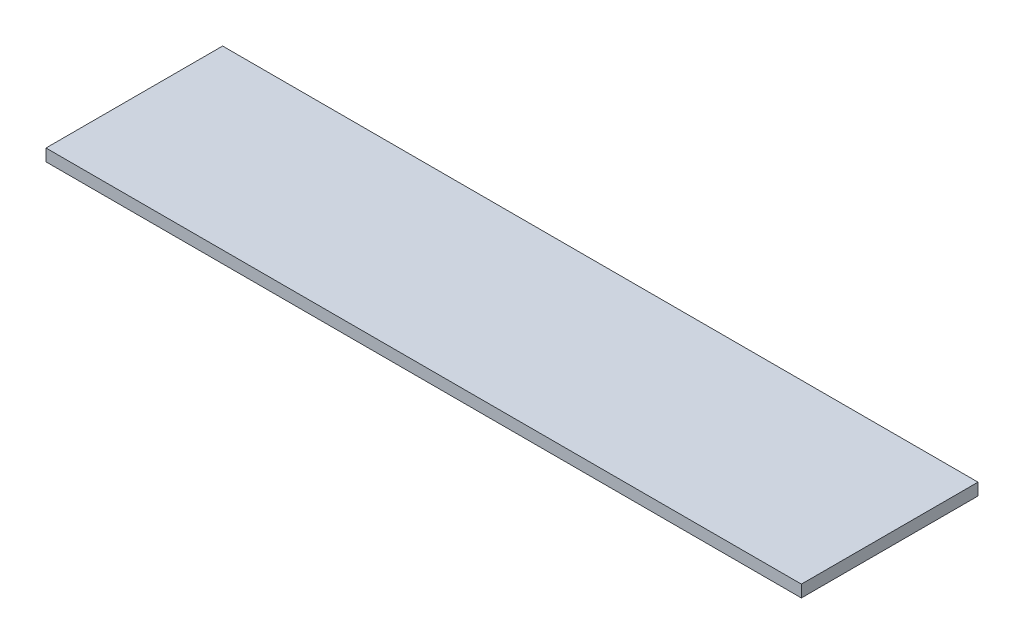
ISO-10303-21;
HEADER;
FILE_DESCRIPTION(('STEP AP214'),'2;1');
FILE_NAME('part.step','',(''),(''),'','','');
FILE_SCHEMA(('AUTOMOTIVE_DESIGN { 1 0 10303 214 1 1 1 1 }'));
ENDSEC;
DATA;
#1=APPLICATION_CONTEXT('core data for automotive mechanical design processes');
#2=APPLICATION_PROTOCOL_DEFINITION('international standard','automotive_design',2000,#1);
#3=PRODUCT_CONTEXT('',#1,'mechanical');
#4=PRODUCT('Part','Part','',(#3));
#5=PRODUCT_RELATED_PRODUCT_CATEGORY('part','',(#4));
#6=PRODUCT_DEFINITION_FORMATION('','',#4);
#7=PRODUCT_DEFINITION_CONTEXT('part definition',#1,'design');
#8=PRODUCT_DEFINITION('design','',#6,#7);
#9=PRODUCT_DEFINITION_SHAPE('','',#8);
#10=(LENGTH_UNIT() NAMED_UNIT(*) SI_UNIT(.MILLI.,.METRE.));
#11=(NAMED_UNIT(*) PLANE_ANGLE_UNIT() SI_UNIT($,.RADIAN.));
#12=(NAMED_UNIT(*) SI_UNIT($,.STERADIAN.) SOLID_ANGLE_UNIT());
#13=UNCERTAINTY_MEASURE_WITH_UNIT(LENGTH_MEASURE(1.E-05),#10,'distance_accuracy_value','');
#14=(GEOMETRIC_REPRESENTATION_CONTEXT(3) GLOBAL_UNCERTAINTY_ASSIGNED_CONTEXT((#13)) GLOBAL_UNIT_ASSIGNED_CONTEXT((#10,
#11,#12)) REPRESENTATION_CONTEXT('',''));
#15=CARTESIAN_POINT('',(0.,0.,0.));
#16=DIRECTION('',(0.,0.,1.));
#17=DIRECTION('',(1.,0.,0.));
#18=AXIS2_PLACEMENT_3D('',#15,#16,#17);
#19=CARTESIAN_POINT('',(598.782,19.05,140.));
#20=DIRECTION('',(-1.,0.,0.));
#21=DIRECTION('',(0.,0.,1.));
#22=AXIS2_PLACEMENT_3D('',#19,#20,#21);
#23=PLANE('',#22);
#24=DIRECTION('',(0.,0.,-1.));
#25=VECTOR('',#24,1.);
#26=CARTESIAN_POINT('',(598.782,0.,140.));
#27=LINE('',#26,#25);
#28=CARTESIAN_POINT('',(598.782,0.,140.));
#29=VERTEX_POINT('',#28);
#30=CARTESIAN_POINT('',(598.782,0.,-140.));
#31=VERTEX_POINT('',#30);
#32=EDGE_CURVE('E113',#29,#31,#27,.T.);
#33=ORIENTED_EDGE('',*,*,#32,.T.);
#34=DIRECTION('',(0.,-1.,0.));
#35=VECTOR('',#34,1.);
#36=CARTESIAN_POINT('',(598.782,19.05,-140.));
#37=LINE('',#36,#35);
#38=CARTESIAN_POINT('',(598.782,19.05,-140.));
#39=VERTEX_POINT('',#38);
#40=EDGE_CURVE('E11',#39,#31,#37,.T.);
#41=ORIENTED_EDGE('',*,*,#40,.F.);
#42=DIRECTION('',(0.,0.,-1.));
#43=VECTOR('',#42,1.);
#44=CARTESIAN_POINT('',(598.782,19.05,140.));
#45=LINE('',#44,#43);
#46=CARTESIAN_POINT('',(598.782,19.05,140.));
#47=VERTEX_POINT('',#46);
#48=EDGE_CURVE('E97',#47,#39,#45,.T.);
#49=ORIENTED_EDGE('',*,*,#48,.F.);
#50=DIRECTION('',(0.,-1.,0.));
#51=VECTOR('',#50,1.);
#52=CARTESIAN_POINT('',(598.782,19.05,140.));
#53=LINE('',#52,#51);
#54=EDGE_CURVE('E107',#47,#29,#53,.T.);
#55=ORIENTED_EDGE('',*,*,#54,.T.);
#56=EDGE_LOOP('',(#33,#41,#49,#55));
#57=FACE_BOUND('',#56,.T.);
#58=ADVANCED_FACE('F44',(#57),#23,.F.);
#59=CARTESIAN_POINT('',(598.782,19.05,-140.));
#60=DIRECTION('',(0.,0.,1.));
#61=DIRECTION('',(1.,0.,0.));
#62=AXIS2_PLACEMENT_3D('',#59,#60,#61);
#63=PLANE('',#62);
#64=DIRECTION('',(-1.,0.,0.));
#65=VECTOR('',#64,1.);
#66=CARTESIAN_POINT('',(598.782,0.,-140.));
#67=LINE('',#66,#65);
#68=CARTESIAN_POINT('',(-598.782,0.,-140.));
#69=VERTEX_POINT('',#68);
#70=EDGE_CURVE('E105',#31,#69,#67,.T.);
#71=ORIENTED_EDGE('',*,*,#70,.T.);
#72=DIRECTION('',(0.,-1.,0.));
#73=VECTOR('',#72,1.);
#74=CARTESIAN_POINT('',(-598.782,19.05,-140.));
#75=LINE('',#74,#73);
#76=CARTESIAN_POINT('',(-598.782,19.05,-140.));
#77=VERTEX_POINT('',#76);
#78=EDGE_CURVE('E53',#77,#69,#75,.T.);
#79=ORIENTED_EDGE('',*,*,#78,.F.);
#80=DIRECTION('',(-1.,0.,0.));
#81=VECTOR('',#80,1.);
#82=CARTESIAN_POINT('',(598.782,19.05,-140.));
#83=LINE('',#82,#81);
#84=EDGE_CURVE('E95',#39,#77,#83,.T.);
#85=ORIENTED_EDGE('',*,*,#84,.F.);
#86=ORIENTED_EDGE('',*,*,#40,.T.);
#87=EDGE_LOOP('',(#71,#79,#85,#86));
#88=FACE_BOUND('',#87,.T.);
#89=ADVANCED_FACE('F103',(#88),#63,.F.);
#90=CARTESIAN_POINT('',(-598.782,19.05,140.));
#91=DIRECTION('',(1.,0.,0.));
#92=DIRECTION('',(0.,0.,-1.));
#93=AXIS2_PLACEMENT_3D('',#90,#91,#92);
#94=PLANE('',#93);
#95=DIRECTION('',(0.,0.,1.));
#96=VECTOR('',#95,1.);
#97=CARTESIAN_POINT('',(-598.782,0.,140.));
#98=LINE('',#97,#96);
#99=CARTESIAN_POINT('',(-598.782,0.,140.));
#100=VERTEX_POINT('',#99);
#101=EDGE_CURVE('E79',#69,#100,#98,.T.);
#102=ORIENTED_EDGE('',*,*,#101,.T.);
#103=DIRECTION('',(0.,-1.,0.));
#104=VECTOR('',#103,1.);
#105=CARTESIAN_POINT('',(-598.782,19.05,140.));
#106=LINE('',#105,#104);
#107=CARTESIAN_POINT('',(-598.782,19.05,140.));
#108=VERTEX_POINT('',#107);
#109=EDGE_CURVE('E104',#108,#100,#106,.T.);
#110=ORIENTED_EDGE('',*,*,#109,.F.);
#111=DIRECTION('',(0.,0.,1.));
#112=VECTOR('',#111,1.);
#113=CARTESIAN_POINT('',(-598.782,19.05,140.));
#114=LINE('',#113,#112);
#115=EDGE_CURVE('E93',#77,#108,#114,.T.);
#116=ORIENTED_EDGE('',*,*,#115,.F.);
#117=ORIENTED_EDGE('',*,*,#78,.T.);
#118=EDGE_LOOP('',(#102,#110,#116,#117));
#119=FACE_BOUND('',#118,.T.);
#120=ADVANCED_FACE('F102',(#119),#94,.F.);
#121=CARTESIAN_POINT('',(598.782,19.05,140.));
#122=DIRECTION('',(0.,0.,-1.));
#123=DIRECTION('',(-1.,0.,0.));
#124=AXIS2_PLACEMENT_3D('',#121,#122,#123);
#125=PLANE('',#124);
#126=DIRECTION('',(1.,0.,0.));
#127=VECTOR('',#126,1.);
#128=CARTESIAN_POINT('',(598.782,0.,140.));
#129=LINE('',#128,#127);
#130=EDGE_CURVE('E83',#100,#29,#129,.T.);
#131=ORIENTED_EDGE('',*,*,#130,.T.);
#132=ORIENTED_EDGE('',*,*,#54,.F.);
#133=DIRECTION('',(1.,0.,0.));
#134=VECTOR('',#133,1.);
#135=CARTESIAN_POINT('',(598.782,19.05,140.));
#136=LINE('',#135,#134);
#137=EDGE_CURVE('E65',#108,#47,#136,.T.);
#138=ORIENTED_EDGE('',*,*,#137,.F.);
#139=ORIENTED_EDGE('',*,*,#109,.T.);
#140=EDGE_LOOP('',(#131,#132,#138,#139));
#141=FACE_BOUND('',#140,.T.);
#142=ADVANCED_FACE('F127',(#141),#125,.F.);
#143=CARTESIAN_POINT('',(0.,19.05,0.));
#144=DIRECTION('',(0.,1.,0.));
#145=DIRECTION('',(0.,0.,1.));
#146=AXIS2_PLACEMENT_3D('',#143,#144,#145);
#147=PLANE('',#146);
#148=ORIENTED_EDGE('',*,*,#48,.T.);
#149=ORIENTED_EDGE('',*,*,#84,.T.);
#150=ORIENTED_EDGE('',*,*,#115,.T.);
#151=ORIENTED_EDGE('',*,*,#137,.T.);
#152=EDGE_LOOP('',(#148,#149,#150,#151));
#153=FACE_BOUND('',#152,.T.);
#154=ADVANCED_FACE('F94',(#153),#147,.T.);
#155=CARTESIAN_POINT('',(0.,0.,0.));
#156=DIRECTION('',(0.,1.,0.));
#157=DIRECTION('',(0.,0.,1.));
#158=AXIS2_PLACEMENT_3D('',#155,#156,#157);
#159=PLANE('',#158);
#160=ORIENTED_EDGE('',*,*,#32,.F.);
#161=ORIENTED_EDGE('',*,*,#130,.F.);
#162=ORIENTED_EDGE('',*,*,#101,.F.);
#163=ORIENTED_EDGE('',*,*,#70,.F.);
#164=EDGE_LOOP('',(#160,#161,#162,#163));
#165=FACE_BOUND('',#164,.T.);
#166=ADVANCED_FACE('F126',(#165),#159,.F.);
#167=CLOSED_SHELL('',(#58,#89,#120,#142,#154,#166));
#168=MANIFOLD_SOLID_BREP('B2',#167);
#169=ADVANCED_BREP_SHAPE_REPRESENTATION('',(#18,#168),#14);
#170=SHAPE_DEFINITION_REPRESENTATION(#9,#169);
ENDSEC;
END-ISO-10303-21;
